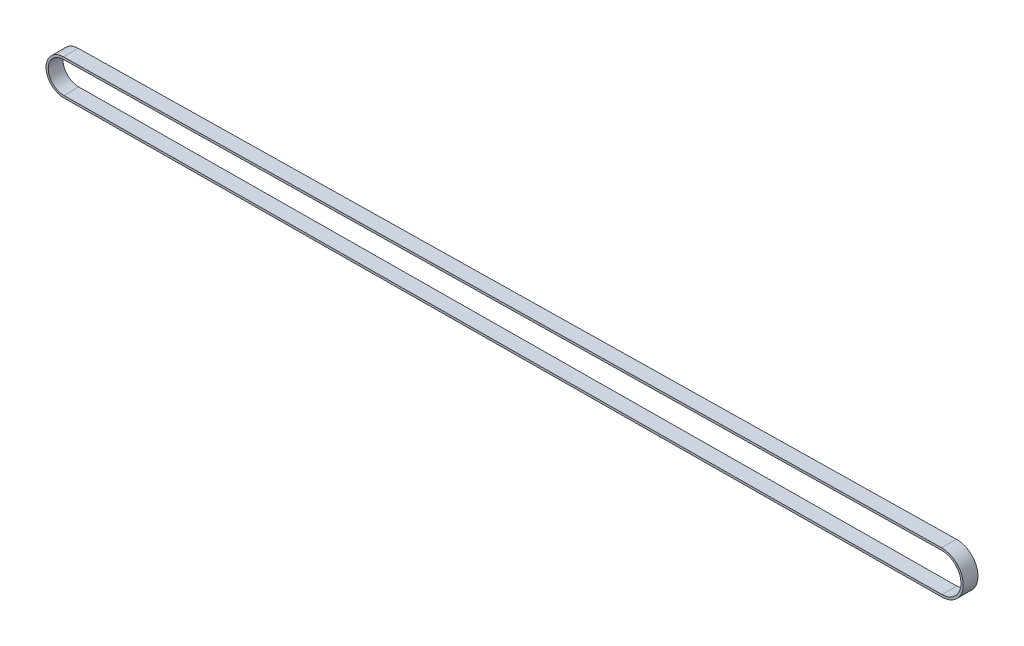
from build123d import *

# Parameters (mm, degrees)
EXTRUDE_THIN1_DEPTH = 2.5


with BuildPart() as part:
    # Sketch2 → Extrude-Thin1 (new, symmetric)
    with BuildSketch(Plane(origin=(14.347712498, -36.710693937, 0), x_dir=(1, 0, 0), z_dir=(0, 0, 1))):
        with BuildLine():
            Line((296.803468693, -8.504975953), (0.544176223, -10.799195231))
            ThreePointArc((0.544176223, -10.799195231), (-5.47667697, -4.89484288), (0.403240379, 1.149875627))
            Line((0.403240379, 1.149875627), (296.634227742, 5.843908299))
            ThreePointArc((296.634227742, 5.843908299), (303.922408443, -1.245569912), (296.803468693, -8.504975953))
        make_face()
        with BuildLine():
            Line((296.7976609, -7.75499844), (0.53836843, -10.049217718))
            ThreePointArc((0.53836843, -10.049217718), (-4.726729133, -4.885997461), (0.415123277, 0.399969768))
            Line((0.415123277, 0.399969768), (296.64611064, 5.09400244))
            ThreePointArc((296.64611064, 5.09400244), (303.172460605, -1.254415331), (296.7976609, -7.75499844))
        make_face(mode=Mode.SUBTRACT)
    extrude(amount=EXTRUDE_THIN1_DEPTH, both=True)


solid = part.part
